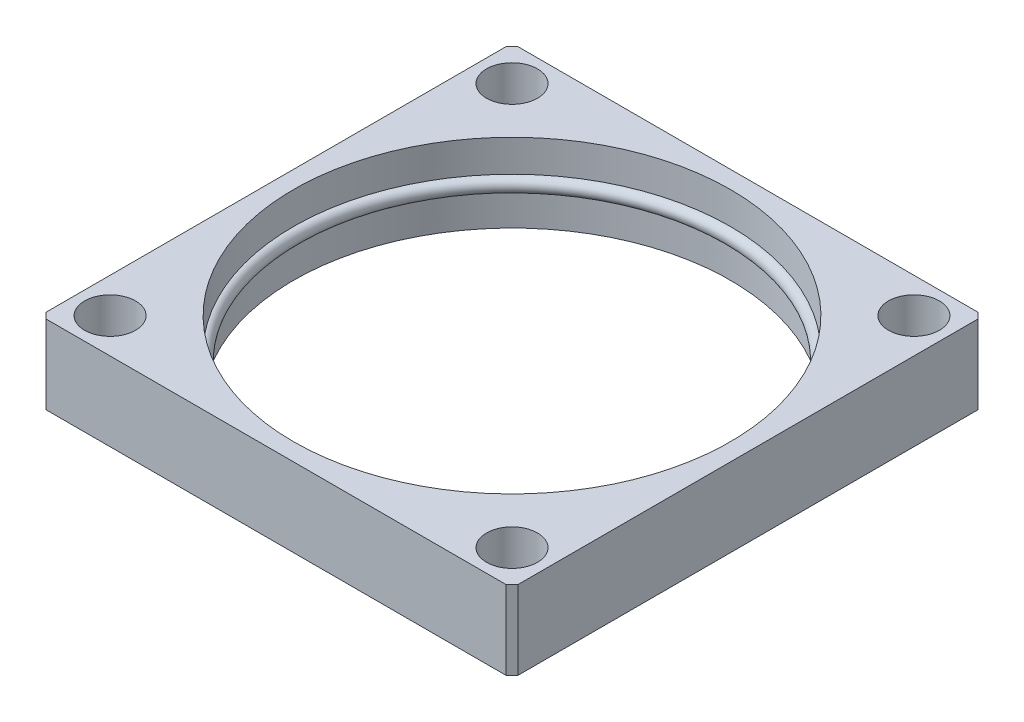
from build123d import *

# Parameters (mm, degrees)
SKETCH1_R           = 75
SKETCH1_R_2         = 8.75
BOSS_EXTRUDE1_DEPTH = 13.5
SKETCH2_R           = 2.5


with BuildPart() as part:
    # Sketch1 → Boss-Extrude1 (new, symmetric)
    with BuildSketch(Plane(origin=(0, 0, 0), x_dir=(1, 0, 0), z_dir=(0, 1, 0))):
        Polygon((-81, 79), (-79, 81), (79, 81), (81, 79), (81, -79), (79, -81), (-79, -81), (-81, -79), align=None)
        with Locations(Location((0, 0, 0), (0, 0, 270))):
            Circle(SKETCH1_R, mode=Mode.SUBTRACT)
        with Locations(Location((-69, 69, 0), (0, 0, 270))):
            Circle(SKETCH1_R_2, mode=Mode.SUBTRACT)
        with Locations(Location((69, 69, 0), (0, 0, 270))):
            Circle(SKETCH1_R_2, mode=Mode.SUBTRACT)
        with Locations(Location((69, -69, 0), (0, 0, 270))):
            Circle(SKETCH1_R_2, mode=Mode.SUBTRACT)
        with Locations(Location((-69, -69, 0), (0, 0, 270))):
            Circle(SKETCH1_R_2, mode=Mode.SUBTRACT)
    extrude(amount=BOSS_EXTRUDE1_DEPTH, both=True)

    # Sketch2 → Revolve1 (revolve)
    with BuildSketch(Plane.XY, mode=Mode.PRIVATE) as revolve1_sk:
        with Locations((-75, 0)):
            Circle(SKETCH2_R)
    revolve(revolve1_sk.sketch.rotate(Axis((0, 0, 0), (0, 1, 0)), 270), axis=Axis((0, 0, 0), (0, 1, 0)))


solid = part.part
